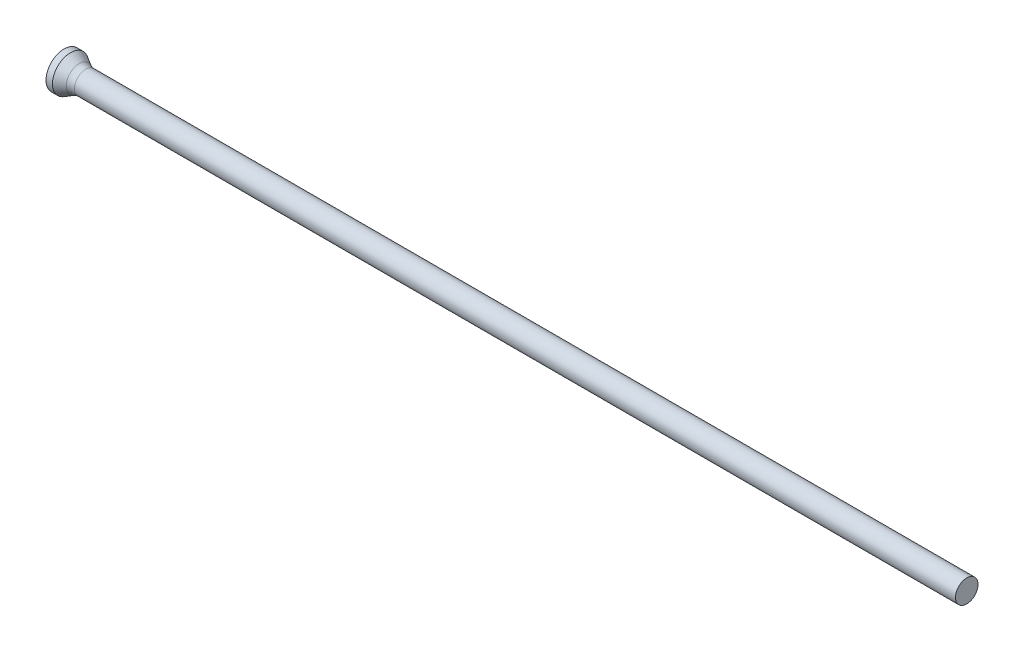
ISO-10303-21;
HEADER;
FILE_DESCRIPTION(('STEP AP214'),'2;1');
FILE_NAME('part.step','',(''),(''),'','','');
FILE_SCHEMA(('AUTOMOTIVE_DESIGN { 1 0 10303 214 1 1 1 1 }'));
ENDSEC;
DATA;
#1=APPLICATION_CONTEXT('core data for automotive mechanical design processes');
#2=APPLICATION_PROTOCOL_DEFINITION('international standard','automotive_design',2000,#1);
#3=PRODUCT_CONTEXT('',#1,'mechanical');
#4=PRODUCT('Part','Part','',(#3));
#5=PRODUCT_RELATED_PRODUCT_CATEGORY('part','',(#4));
#6=PRODUCT_DEFINITION_FORMATION('','',#4);
#7=PRODUCT_DEFINITION_CONTEXT('part definition',#1,'design');
#8=PRODUCT_DEFINITION('design','',#6,#7);
#9=PRODUCT_DEFINITION_SHAPE('','',#8);
#10=(LENGTH_UNIT() NAMED_UNIT(*) SI_UNIT(.MILLI.,.METRE.));
#11=(NAMED_UNIT(*) PLANE_ANGLE_UNIT() SI_UNIT($,.RADIAN.));
#12=(NAMED_UNIT(*) SI_UNIT($,.STERADIAN.) SOLID_ANGLE_UNIT());
#13=UNCERTAINTY_MEASURE_WITH_UNIT(LENGTH_MEASURE(1.E-05),#10,'distance_accuracy_value','');
#14=(GEOMETRIC_REPRESENTATION_CONTEXT(3) GLOBAL_UNCERTAINTY_ASSIGNED_CONTEXT((#13)) GLOBAL_UNIT_ASSIGNED_CONTEXT((#10,
#11,#12)) REPRESENTATION_CONTEXT('',''));
#15=CARTESIAN_POINT('',(0.,0.,0.));
#16=DIRECTION('',(0.,0.,1.));
#17=DIRECTION('',(1.,0.,0.));
#18=AXIS2_PLACEMENT_3D('',#15,#16,#17);
#19=CARTESIAN_POINT('',(0.,0.,0.));
#20=DIRECTION('',(1.,0.,0.));
#21=DIRECTION('',(0.,0.,-1.));
#22=AXIS2_PLACEMENT_3D('',#19,#20,#21);
#23=PLANE('',#22);
#24=CARTESIAN_POINT('',(0.,0.,0.));
#25=DIRECTION('',(-1.,0.,0.));
#26=DIRECTION('',(0.,0.,1.));
#27=AXIS2_PLACEMENT_3D('',#24,#25,#26);
#28=CIRCLE('',#27,1.4);
#29=CARTESIAN_POINT('',(0.,0.,1.4));
#30=VERTEX_POINT('',#29);
#31=EDGE_CURVE('E25',#30,#30,#28,.T.);
#32=ORIENTED_EDGE('',*,*,#31,.T.);
#33=EDGE_LOOP('',(#32));
#34=FACE_BOUND('',#33,.T.);
#35=ADVANCED_FACE('F14',(#34),#23,.F.);
#36=CARTESIAN_POINT('',(0.,0.,0.));
#37=DIRECTION('',(-1.,0.,0.));
#38=DIRECTION('',(0.,0.,1.));
#39=AXIS2_PLACEMENT_3D('',#36,#37,#38);
#40=CYLINDRICAL_SURFACE('',#39,1.4);
#41=ORIENTED_EDGE('',*,*,#31,.F.);
#42=EDGE_LOOP('',(#41));
#43=FACE_BOUND('',#42,.T.);
#44=CARTESIAN_POINT('',(0.500673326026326,0.,0.));
#45=DIRECTION('',(-1.,0.,0.));
#46=DIRECTION('',(0.,0.,1.));
#47=AXIS2_PLACEMENT_3D('',#44,#45,#46);
#48=CIRCLE('',#47,1.4);
#49=CARTESIAN_POINT('',(0.500673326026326,0.,1.4));
#50=VERTEX_POINT('',#49);
#51=EDGE_CURVE('E29',#50,#50,#48,.T.);
#52=ORIENTED_EDGE('',*,*,#51,.T.);
#53=EDGE_LOOP('',(#52));
#54=FACE_BOUND('',#53,.T.);
#55=ADVANCED_FACE('F53',(#43,#54),#40,.T.);
#56=CARTESIAN_POINT('',(1.41,0.,0.));
#57=DIRECTION('',(-1.,0.,0.));
#58=DIRECTION('',(0.,0.,1.));
#59=AXIS2_PLACEMENT_3D('',#56,#57,#58);
#60=CONICAL_SURFACE('',#59,0.875,0.523598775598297);
#61=CARTESIAN_POINT('',(1.17794919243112,0.,0.));
#62=DIRECTION('',(-1.,0.,0.));
#63=DIRECTION('',(0.,0.,1.));
#64=AXIS2_PLACEMENT_3D('',#61,#62,#63);
#65=CIRCLE('',#64,1.00897459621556);
#66=CARTESIAN_POINT('',(1.17794919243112,0.,1.00897459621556));
#67=VERTEX_POINT('',#66);
#68=EDGE_CURVE('E21',#67,#67,#65,.T.);
#69=ORIENTED_EDGE('',*,*,#68,.T.);
#70=EDGE_LOOP('',(#69));
#71=FACE_BOUND('',#70,.T.);
#72=ORIENTED_EDGE('',*,*,#51,.F.);
#73=EDGE_LOOP('',(#72));
#74=FACE_BOUND('',#73,.T.);
#75=ADVANCED_FACE('F50',(#71,#74),#60,.T.);
#76=CARTESIAN_POINT('',(0.,0.,0.));
#77=DIRECTION('',(-1.,0.,0.));
#78=DIRECTION('',(0.,0.,1.));
#79=AXIS2_PLACEMENT_3D('',#76,#77,#78);
#80=CYLINDRICAL_SURFACE('',#79,0.875);
#81=CARTESIAN_POINT('',(1.67794919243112,0.,0.));
#82=DIRECTION('',(-1.,0.,0.));
#83=DIRECTION('',(0.,0.,1.));
#84=AXIS2_PLACEMENT_3D('',#81,#82,#83);
#85=CIRCLE('',#84,0.875);
#86=CARTESIAN_POINT('',(1.67794919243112,0.,0.875));
#87=VERTEX_POINT('',#86);
#88=EDGE_CURVE('E9',#87,#87,#85,.F.);
#89=ORIENTED_EDGE('',*,*,#88,.T.);
#90=EDGE_LOOP('',(#89));
#91=FACE_BOUND('',#90,.T.);
#92=CARTESIAN_POINT('',(70.,0.,0.));
#93=DIRECTION('',(-1.,0.,0.));
#94=DIRECTION('',(0.,0.,1.));
#95=AXIS2_PLACEMENT_3D('',#92,#93,#94);
#96=CIRCLE('',#95,0.875);
#97=CARTESIAN_POINT('',(70.,0.,0.875));
#98=VERTEX_POINT('',#97);
#99=EDGE_CURVE('E34',#98,#98,#96,.T.);
#100=ORIENTED_EDGE('',*,*,#99,.T.);
#101=EDGE_LOOP('',(#100));
#102=FACE_BOUND('',#101,.T.);
#103=ADVANCED_FACE('F38',(#91,#102),#80,.T.);
#104=CARTESIAN_POINT('',(70.,0.875,0.));
#105=DIRECTION('',(-1.,0.,0.));
#106=DIRECTION('',(0.,0.,1.));
#107=AXIS2_PLACEMENT_3D('',#104,#105,#106);
#108=PLANE('',#107);
#109=ORIENTED_EDGE('',*,*,#99,.F.);
#110=EDGE_LOOP('',(#109));
#111=FACE_BOUND('',#110,.T.);
#112=ADVANCED_FACE('F40',(#111),#108,.F.);
#113=CARTESIAN_POINT('',(1.67794919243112,0.,0.));
#114=DIRECTION('',(-1.,0.,0.));
#115=DIRECTION('',(0.,0.,1.));
#116=AXIS2_PLACEMENT_3D('',#113,#114,#115);
#117=TOROIDAL_SURFACE('',#116,1.875,1.);
#118=ORIENTED_EDGE('',*,*,#88,.F.);
#119=EDGE_LOOP('',(#118));
#120=FACE_BOUND('',#119,.T.);
#121=ORIENTED_EDGE('',*,*,#68,.F.);
#122=EDGE_LOOP('',(#121));
#123=FACE_BOUND('',#122,.T.);
#124=ADVANCED_FACE('F16',(#120,#123),#117,.F.);
#125=CLOSED_SHELL('',(#35,#55,#75,#103,#112,#124));
#126=MANIFOLD_SOLID_BREP('B1',#125);
#127=ADVANCED_BREP_SHAPE_REPRESENTATION('',(#18,#126),#14);
#128=SHAPE_DEFINITION_REPRESENTATION(#9,#127);
ENDSEC;
END-ISO-10303-21;
